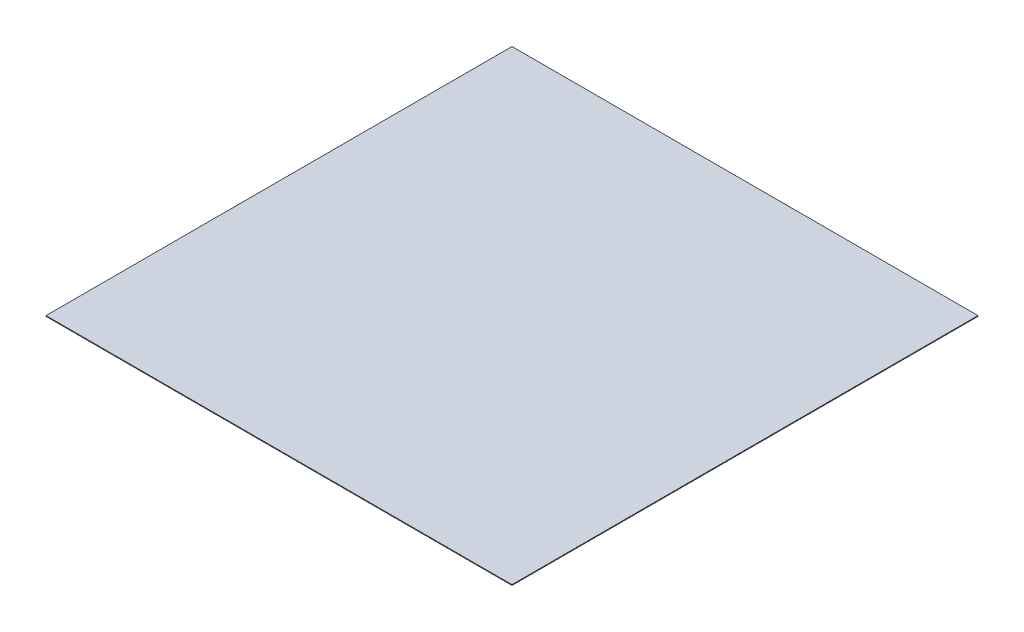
ISO-10303-21;
HEADER;
FILE_DESCRIPTION(('STEP AP214'),'2;1');
FILE_NAME('part.step','',(''),(''),'','','');
FILE_SCHEMA(('AUTOMOTIVE_DESIGN { 1 0 10303 214 1 1 1 1 }'));
ENDSEC;
DATA;
#1=APPLICATION_CONTEXT('core data for automotive mechanical design processes');
#2=APPLICATION_PROTOCOL_DEFINITION('international standard','automotive_design',2000,#1);
#3=PRODUCT_CONTEXT('',#1,'mechanical');
#4=PRODUCT('Part','Part','',(#3));
#5=PRODUCT_RELATED_PRODUCT_CATEGORY('part','',(#4));
#6=PRODUCT_DEFINITION_FORMATION('','',#4);
#7=PRODUCT_DEFINITION_CONTEXT('part definition',#1,'design');
#8=PRODUCT_DEFINITION('design','',#6,#7);
#9=PRODUCT_DEFINITION_SHAPE('','',#8);
#10=(LENGTH_UNIT() NAMED_UNIT(*) SI_UNIT(.MILLI.,.METRE.));
#11=(NAMED_UNIT(*) PLANE_ANGLE_UNIT() SI_UNIT($,.RADIAN.));
#12=(NAMED_UNIT(*) SI_UNIT($,.STERADIAN.) SOLID_ANGLE_UNIT());
#13=UNCERTAINTY_MEASURE_WITH_UNIT(LENGTH_MEASURE(1.E-05),#10,'distance_accuracy_value','');
#14=(GEOMETRIC_REPRESENTATION_CONTEXT(3) GLOBAL_UNCERTAINTY_ASSIGNED_CONTEXT((#13)) GLOBAL_UNIT_ASSIGNED_CONTEXT((#10,
#11,#12)) REPRESENTATION_CONTEXT('',''));
#15=CARTESIAN_POINT('',(0.,0.,0.));
#16=DIRECTION('',(0.,0.,1.));
#17=DIRECTION('',(1.,0.,0.));
#18=AXIS2_PLACEMENT_3D('',#15,#16,#17);
#19=CARTESIAN_POINT('',(-609.6,1.905,609.6));
#20=DIRECTION('',(1.,0.,0.));
#21=DIRECTION('',(0.,0.,-1.));
#22=AXIS2_PLACEMENT_3D('',#19,#20,#21);
#23=PLANE('',#22);
#24=DIRECTION('',(0.,0.,1.));
#25=VECTOR('',#24,1.);
#26=CARTESIAN_POINT('',(-609.6,0.,609.6));
#27=LINE('',#26,#25);
#28=CARTESIAN_POINT('',(-609.6,0.,-609.6));
#29=VERTEX_POINT('',#28);
#30=CARTESIAN_POINT('',(-609.6,0.,609.6));
#31=VERTEX_POINT('',#30);
#32=EDGE_CURVE('E95',#29,#31,#27,.T.);
#33=ORIENTED_EDGE('',*,*,#32,.T.);
#34=DIRECTION('',(0.,-1.,0.));
#35=VECTOR('',#34,1.);
#36=CARTESIAN_POINT('',(-609.6,1.905,609.6));
#37=LINE('',#36,#35);
#38=CARTESIAN_POINT('',(-609.6,1.905,609.6));
#39=VERTEX_POINT('',#38);
#40=EDGE_CURVE('E11',#39,#31,#37,.T.);
#41=ORIENTED_EDGE('',*,*,#40,.F.);
#42=DIRECTION('',(0.,0.,1.));
#43=VECTOR('',#42,1.);
#44=CARTESIAN_POINT('',(-609.6,1.905,609.6));
#45=LINE('',#44,#43);
#46=CARTESIAN_POINT('',(-609.6,1.905,-609.6));
#47=VERTEX_POINT('',#46);
#48=EDGE_CURVE('E83',#47,#39,#45,.T.);
#49=ORIENTED_EDGE('',*,*,#48,.F.);
#50=DIRECTION('',(0.,-1.,0.));
#51=VECTOR('',#50,1.);
#52=CARTESIAN_POINT('',(-609.6,1.905,-609.6));
#53=LINE('',#52,#51);
#54=EDGE_CURVE('E91',#47,#29,#53,.T.);
#55=ORIENTED_EDGE('',*,*,#54,.T.);
#56=EDGE_LOOP('',(#33,#41,#49,#55));
#57=FACE_BOUND('',#56,.T.);
#58=ADVANCED_FACE('F32',(#57),#23,.F.);
#59=CARTESIAN_POINT('',(-609.6,1.905,609.6));
#60=DIRECTION('',(0.,0.,-1.));
#61=DIRECTION('',(-1.,0.,0.));
#62=AXIS2_PLACEMENT_3D('',#59,#60,#61);
#63=PLANE('',#62);
#64=DIRECTION('',(1.,0.,0.));
#65=VECTOR('',#64,1.);
#66=CARTESIAN_POINT('',(-609.6,0.,609.6));
#67=LINE('',#66,#65);
#68=CARTESIAN_POINT('',(609.6,0.,609.6));
#69=VERTEX_POINT('',#68);
#70=EDGE_CURVE('E87',#31,#69,#67,.T.);
#71=ORIENTED_EDGE('',*,*,#70,.T.);
#72=DIRECTION('',(0.,-1.,0.));
#73=VECTOR('',#72,1.);
#74=CARTESIAN_POINT('',(609.6,1.905,609.6));
#75=LINE('',#74,#73);
#76=CARTESIAN_POINT('',(609.6,1.905,609.6));
#77=VERTEX_POINT('',#76);
#78=EDGE_CURVE('E40',#77,#69,#75,.T.);
#79=ORIENTED_EDGE('',*,*,#78,.F.);
#80=DIRECTION('',(1.,0.,0.));
#81=VECTOR('',#80,1.);
#82=CARTESIAN_POINT('',(-609.6,1.905,609.6));
#83=LINE('',#82,#81);
#84=EDGE_CURVE('E78',#39,#77,#83,.T.);
#85=ORIENTED_EDGE('',*,*,#84,.F.);
#86=ORIENTED_EDGE('',*,*,#40,.T.);
#87=EDGE_LOOP('',(#71,#79,#85,#86));
#88=FACE_BOUND('',#87,.T.);
#89=ADVANCED_FACE('F86',(#88),#63,.F.);
#90=CARTESIAN_POINT('',(609.6,1.905,609.6));
#91=DIRECTION('',(-1.,0.,0.));
#92=DIRECTION('',(0.,0.,1.));
#93=AXIS2_PLACEMENT_3D('',#90,#91,#92);
#94=PLANE('',#93);
#95=DIRECTION('',(0.,0.,-1.));
#96=VECTOR('',#95,1.);
#97=CARTESIAN_POINT('',(609.6,0.,609.6));
#98=LINE('',#97,#96);
#99=CARTESIAN_POINT('',(609.6,0.,-609.6));
#100=VERTEX_POINT('',#99);
#101=EDGE_CURVE('E65',#69,#100,#98,.T.);
#102=ORIENTED_EDGE('',*,*,#101,.T.);
#103=DIRECTION('',(0.,-1.,0.));
#104=VECTOR('',#103,1.);
#105=CARTESIAN_POINT('',(609.6,1.905,-609.6));
#106=LINE('',#105,#104);
#107=CARTESIAN_POINT('',(609.6,1.905,-609.6));
#108=VERTEX_POINT('',#107);
#109=EDGE_CURVE('E88',#108,#100,#106,.T.);
#110=ORIENTED_EDGE('',*,*,#109,.F.);
#111=DIRECTION('',(0.,0.,-1.));
#112=VECTOR('',#111,1.);
#113=CARTESIAN_POINT('',(609.6,1.905,609.6));
#114=LINE('',#113,#112);
#115=EDGE_CURVE('E81',#77,#108,#114,.T.);
#116=ORIENTED_EDGE('',*,*,#115,.F.);
#117=ORIENTED_EDGE('',*,*,#78,.T.);
#118=EDGE_LOOP('',(#102,#110,#116,#117));
#119=FACE_BOUND('',#118,.T.);
#120=ADVANCED_FACE('F89',(#119),#94,.F.);
#121=CARTESIAN_POINT('',(-609.6,1.905,-609.6));
#122=DIRECTION('',(0.,0.,1.));
#123=DIRECTION('',(1.,0.,0.));
#124=AXIS2_PLACEMENT_3D('',#121,#122,#123);
#125=PLANE('',#124);
#126=DIRECTION('',(-1.,0.,0.));
#127=VECTOR('',#126,1.);
#128=CARTESIAN_POINT('',(-609.6,0.,-609.6));
#129=LINE('',#128,#127);
#130=EDGE_CURVE('E71',#100,#29,#129,.T.);
#131=ORIENTED_EDGE('',*,*,#130,.T.);
#132=ORIENTED_EDGE('',*,*,#54,.F.);
#133=DIRECTION('',(-1.,0.,0.));
#134=VECTOR('',#133,1.);
#135=CARTESIAN_POINT('',(-609.6,1.905,-609.6));
#136=LINE('',#135,#134);
#137=EDGE_CURVE('E48',#108,#47,#136,.T.);
#138=ORIENTED_EDGE('',*,*,#137,.F.);
#139=ORIENTED_EDGE('',*,*,#109,.T.);
#140=EDGE_LOOP('',(#131,#132,#138,#139));
#141=FACE_BOUND('',#140,.T.);
#142=ADVANCED_FACE('F102',(#141),#125,.F.);
#143=CARTESIAN_POINT('',(-609.6,1.905,-609.6));
#144=DIRECTION('',(0.,-1.,0.));
#145=DIRECTION('',(0.,0.,-1.));
#146=AXIS2_PLACEMENT_3D('',#143,#144,#145);
#147=PLANE('',#146);
#148=ORIENTED_EDGE('',*,*,#48,.T.);
#149=ORIENTED_EDGE('',*,*,#84,.T.);
#150=ORIENTED_EDGE('',*,*,#115,.T.);
#151=ORIENTED_EDGE('',*,*,#137,.T.);
#152=EDGE_LOOP('',(#148,#149,#150,#151));
#153=FACE_BOUND('',#152,.T.);
#154=ADVANCED_FACE('F79',(#153),#147,.F.);
#155=CARTESIAN_POINT('',(-609.6,0.,-609.6));
#156=DIRECTION('',(0.,-1.,0.));
#157=DIRECTION('',(0.,0.,-1.));
#158=AXIS2_PLACEMENT_3D('',#155,#156,#157);
#159=PLANE('',#158);
#160=ORIENTED_EDGE('',*,*,#32,.F.);
#161=ORIENTED_EDGE('',*,*,#130,.F.);
#162=ORIENTED_EDGE('',*,*,#101,.F.);
#163=ORIENTED_EDGE('',*,*,#70,.F.);
#164=EDGE_LOOP('',(#160,#161,#162,#163));
#165=FACE_BOUND('',#164,.T.);
#166=ADVANCED_FACE('F105',(#165),#159,.T.);
#167=CLOSED_SHELL('',(#58,#89,#120,#142,#154,#166));
#168=MANIFOLD_SOLID_BREP('B2',#167);
#169=ADVANCED_BREP_SHAPE_REPRESENTATION('',(#18,#168),#14);
#170=SHAPE_DEFINITION_REPRESENTATION(#9,#169);
ENDSEC;
END-ISO-10303-21;
